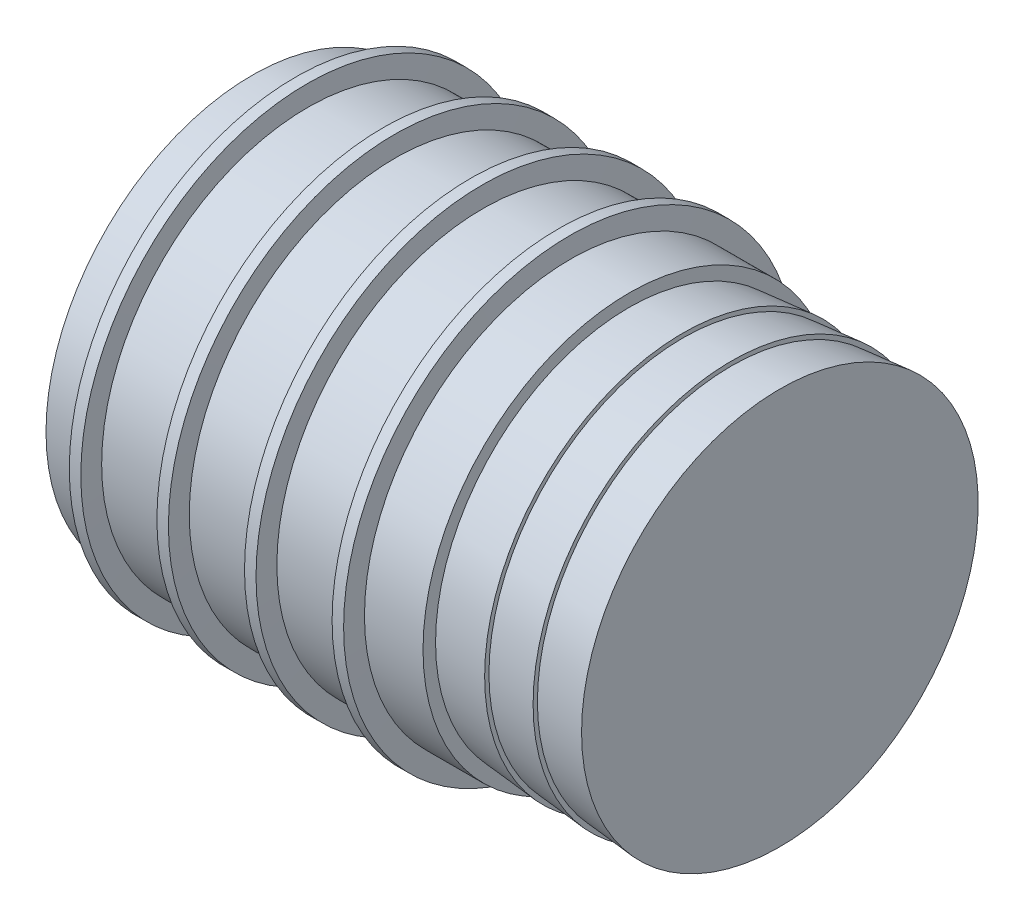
ISO-10303-21;
HEADER;
FILE_DESCRIPTION(('STEP AP214'),'2;1');
FILE_NAME('part.step','',(''),(''),'','','');
FILE_SCHEMA(('AUTOMOTIVE_DESIGN { 1 0 10303 214 1 1 1 1 }'));
ENDSEC;
DATA;
#1=APPLICATION_CONTEXT('core data for automotive mechanical design processes');
#2=APPLICATION_PROTOCOL_DEFINITION('international standard','automotive_design',2000,#1);
#3=PRODUCT_CONTEXT('',#1,'mechanical');
#4=PRODUCT('Part','Part','',(#3));
#5=PRODUCT_RELATED_PRODUCT_CATEGORY('part','',(#4));
#6=PRODUCT_DEFINITION_FORMATION('','',#4);
#7=PRODUCT_DEFINITION_CONTEXT('part definition',#1,'design');
#8=PRODUCT_DEFINITION('design','',#6,#7);
#9=PRODUCT_DEFINITION_SHAPE('','',#8);
#10=(LENGTH_UNIT() NAMED_UNIT(*) SI_UNIT(.MILLI.,.METRE.));
#11=(NAMED_UNIT(*) PLANE_ANGLE_UNIT() SI_UNIT($,.RADIAN.));
#12=(NAMED_UNIT(*) SI_UNIT($,.STERADIAN.) SOLID_ANGLE_UNIT());
#13=UNCERTAINTY_MEASURE_WITH_UNIT(LENGTH_MEASURE(1.E-05),#10,'distance_accuracy_value','');
#14=(GEOMETRIC_REPRESENTATION_CONTEXT(3) GLOBAL_UNCERTAINTY_ASSIGNED_CONTEXT((#13)) GLOBAL_UNIT_ASSIGNED_CONTEXT((#10,
#11,#12)) REPRESENTATION_CONTEXT('',''));
#15=CARTESIAN_POINT('',(0.,0.,0.));
#16=DIRECTION('',(0.,0.,1.));
#17=DIRECTION('',(1.,0.,0.));
#18=AXIS2_PLACEMENT_3D('',#15,#16,#17);
#19=CARTESIAN_POINT('',(14.,0.,0.));
#20=DIRECTION('',(1.,0.,0.));
#21=DIRECTION('',(0.,0.,-1.));
#22=AXIS2_PLACEMENT_3D('',#19,#20,#21);
#23=PLANE('',#22);
#24=CARTESIAN_POINT('',(14.,0.,0.));
#25=DIRECTION('',(-1.,0.,0.));
#26=DIRECTION('',(0.,0.,1.));
#27=AXIS2_PLACEMENT_3D('',#24,#25,#26);
#28=CIRCLE('',#27,5.25968968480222);
#29=CARTESIAN_POINT('',(14.,0.,5.25968968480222));
#30=VERTEX_POINT('',#29);
#31=EDGE_CURVE('E9',#30,#30,#28,.T.);
#32=ORIENTED_EDGE('',*,*,#31,.F.);
#33=EDGE_LOOP('',(#32));
#34=FACE_BOUND('',#33,.T.);
#35=ADVANCED_FACE('F14',(#34),#23,.T.);
#36=CARTESIAN_POINT('',(12.7144174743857,0.,0.));
#37=DIRECTION('',(1.,0.,0.));
#38=DIRECTION('',(0.,0.,-1.));
#39=AXIS2_PLACEMENT_3D('',#36,#37,#38);
#40=CONICAL_SURFACE('',#39,5.14550437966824,0.0885874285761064);
#41=ORIENTED_EDGE('',*,*,#31,.T.);
#42=EDGE_LOOP('',(#41));
#43=FACE_BOUND('',#42,.T.);
#44=CARTESIAN_POINT('',(12.7144174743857,0.,0.));
#45=DIRECTION('',(-1.,0.,0.));
#46=DIRECTION('',(0.,0.,1.));
#47=AXIS2_PLACEMENT_3D('',#44,#45,#46);
#48=CIRCLE('',#47,5.14550437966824);
#49=CARTESIAN_POINT('',(12.7144174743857,0.,5.14550437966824));
#50=VERTEX_POINT('',#49);
#51=EDGE_CURVE('E20',#50,#50,#48,.T.);
#52=ORIENTED_EDGE('',*,*,#51,.F.);
#53=EDGE_LOOP('',(#52));
#54=FACE_BOUND('',#53,.T.);
#55=ADVANCED_FACE('F146',(#43,#54),#40,.T.);
#56=CARTESIAN_POINT('',(12.7144174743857,-1.93159692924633E-12,0.));
#57=DIRECTION('',(1.,0.,0.));
#58=DIRECTION('',(0.,0.,-1.));
#59=AXIS2_PLACEMENT_3D('',#56,#57,#58);
#60=PLANE('',#59);
#61=ORIENTED_EDGE('',*,*,#51,.T.);
#62=EDGE_LOOP('',(#61));
#63=FACE_BOUND('',#62,.T.);
#64=CARTESIAN_POINT('',(12.7144174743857,0.,0.));
#65=DIRECTION('',(-1.,0.,0.));
#66=DIRECTION('',(0.,0.,1.));
#67=AXIS2_PLACEMENT_3D('',#64,#65,#66);
#68=CIRCLE('',#67,5.25968968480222);
#69=CARTESIAN_POINT('',(12.7144174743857,0.,5.25968968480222));
#70=VERTEX_POINT('',#69);
#71=EDGE_CURVE('E24',#70,#70,#68,.T.);
#72=ORIENTED_EDGE('',*,*,#71,.F.);
#73=EDGE_LOOP('',(#72));
#74=FACE_BOUND('',#73,.T.);
#75=ADVANCED_FACE('F152',(#63,#74),#60,.T.);
#76=CARTESIAN_POINT('',(11.4288349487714,0.,0.));
#77=DIRECTION('',(1.,0.,0.));
#78=DIRECTION('',(0.,0.,-1.));
#79=AXIS2_PLACEMENT_3D('',#76,#77,#78);
#80=CONICAL_SURFACE('',#79,5.14550437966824,0.0885874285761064);
#81=ORIENTED_EDGE('',*,*,#71,.T.);
#82=EDGE_LOOP('',(#81));
#83=FACE_BOUND('',#82,.T.);
#84=CARTESIAN_POINT('',(11.4288349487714,0.,0.));
#85=DIRECTION('',(-1.,0.,0.));
#86=DIRECTION('',(0.,0.,1.));
#87=AXIS2_PLACEMENT_3D('',#84,#85,#86);
#88=CIRCLE('',#87,5.14550437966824);
#89=CARTESIAN_POINT('',(11.4288349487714,0.,5.14550437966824));
#90=VERTEX_POINT('',#89);
#91=EDGE_CURVE('E28',#90,#90,#88,.T.);
#92=ORIENTED_EDGE('',*,*,#91,.F.);
#93=EDGE_LOOP('',(#92));
#94=FACE_BOUND('',#93,.T.);
#95=ADVANCED_FACE('F157',(#83,#94),#80,.T.);
#96=CARTESIAN_POINT('',(11.4288349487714,-1.73628894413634E-12,0.));
#97=DIRECTION('',(1.,0.,0.));
#98=DIRECTION('',(0.,0.,-1.));
#99=AXIS2_PLACEMENT_3D('',#96,#97,#98);
#100=PLANE('',#99);
#101=ORIENTED_EDGE('',*,*,#91,.T.);
#102=EDGE_LOOP('',(#101));
#103=FACE_BOUND('',#102,.T.);
#104=CARTESIAN_POINT('',(11.4288349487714,0.,0.));
#105=DIRECTION('',(-1.,0.,0.));
#106=DIRECTION('',(0.,0.,1.));
#107=AXIS2_PLACEMENT_3D('',#104,#105,#106);
#108=CIRCLE('',#107,5.25968968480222);
#109=CARTESIAN_POINT('',(11.4288349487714,0.,5.25968968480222));
#110=VERTEX_POINT('',#109);
#111=EDGE_CURVE('E33',#110,#110,#108,.T.);
#112=ORIENTED_EDGE('',*,*,#111,.F.);
#113=EDGE_LOOP('',(#112));
#114=FACE_BOUND('',#113,.T.);
#115=ADVANCED_FACE('F163',(#103,#114),#100,.T.);
#116=CARTESIAN_POINT('',(10.,0.,0.));
#117=DIRECTION('',(1.,0.,0.));
#118=DIRECTION('',(0.,0.,-1.));
#119=AXIS2_PLACEMENT_3D('',#116,#117,#118);
#120=CONICAL_SURFACE('',#119,5.13278071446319,0.0885874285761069);
#121=ORIENTED_EDGE('',*,*,#111,.T.);
#122=EDGE_LOOP('',(#121));
#123=FACE_BOUND('',#122,.T.);
#124=CARTESIAN_POINT('',(10.,0.,0.));
#125=DIRECTION('',(-1.,0.,0.));
#126=DIRECTION('',(0.,0.,1.));
#127=AXIS2_PLACEMENT_3D('',#124,#125,#126);
#128=CIRCLE('',#127,5.13278071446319);
#129=CARTESIAN_POINT('',(10.,0.,5.13278071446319));
#130=VERTEX_POINT('',#129);
#131=EDGE_CURVE('E36',#130,#130,#128,.T.);
#132=ORIENTED_EDGE('',*,*,#131,.F.);
#133=EDGE_LOOP('',(#132));
#134=FACE_BOUND('',#133,.T.);
#135=ADVANCED_FACE('F167',(#123,#134),#120,.T.);
#136=CARTESIAN_POINT('',(10.,0.,0.));
#137=DIRECTION('',(1.,0.,0.));
#138=DIRECTION('',(0.,0.,-1.));
#139=AXIS2_PLACEMENT_3D('',#136,#137,#138);
#140=PLANE('',#139);
#141=ORIENTED_EDGE('',*,*,#131,.T.);
#142=EDGE_LOOP('',(#141));
#143=FACE_BOUND('',#142,.T.);
#144=CARTESIAN_POINT('',(10.,0.,0.));
#145=DIRECTION('',(-1.,0.,0.));
#146=DIRECTION('',(0.,0.,1.));
#147=AXIS2_PLACEMENT_3D('',#144,#145,#146);
#148=CIRCLE('',#147,5.46527574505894);
#149=CARTESIAN_POINT('',(10.,0.,5.46527574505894));
#150=VERTEX_POINT('',#149);
#151=EDGE_CURVE('E39',#150,#150,#148,.T.);
#152=ORIENTED_EDGE('',*,*,#151,.F.);
#153=EDGE_LOOP('',(#152));
#154=FACE_BOUND('',#153,.T.);
#155=ADVANCED_FACE('F171',(#143,#154),#140,.T.);
#156=CARTESIAN_POINT('',(0.,0.,0.));
#157=DIRECTION('',(-1.,0.,0.));
#158=DIRECTION('',(0.,0.,1.));
#159=AXIS2_PLACEMENT_3D('',#156,#157,#158);
#160=CYLINDRICAL_SURFACE('',#159,5.46527574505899);
#161=CARTESIAN_POINT('',(8.44678294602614,0.,0.));
#162=DIRECTION('',(-1.,0.,0.));
#163=DIRECTION('',(0.,0.,1.));
#164=AXIS2_PLACEMENT_3D('',#161,#162,#163);
#165=CIRCLE('',#164,5.46527574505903);
#166=CARTESIAN_POINT('',(8.44678294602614,0.,5.46527574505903));
#167=VERTEX_POINT('',#166);
#168=EDGE_CURVE('E42',#167,#167,#165,.T.);
#169=ORIENTED_EDGE('',*,*,#168,.F.);
#170=EDGE_LOOP('',(#169));
#171=FACE_BOUND('',#170,.T.);
#172=ORIENTED_EDGE('',*,*,#151,.T.);
#173=EDGE_LOOP('',(#172));
#174=FACE_BOUND('',#173,.T.);
#175=ADVANCED_FACE('F175',(#171,#174),#160,.T.);
#176=CARTESIAN_POINT('',(8.44678294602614,0.,0.));
#177=DIRECTION('',(-1.,0.,0.));
#178=DIRECTION('',(0.,0.,1.));
#179=AXIS2_PLACEMENT_3D('',#176,#177,#178);
#180=CONICAL_SURFACE('',#179,5.46527574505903,1.53691646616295);
#181=CARTESIAN_POINT('',(8.42865962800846,0.,0.));
#182=DIRECTION('',(-1.,0.,0.));
#183=DIRECTION('',(0.,0.,1.));
#184=AXIS2_PLACEMENT_3D('',#181,#182,#183);
#185=CIRCLE('',#184,6.0000000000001);
#186=CARTESIAN_POINT('',(8.42865962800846,0.,6.0000000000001));
#187=VERTEX_POINT('',#186);
#188=EDGE_CURVE('E45',#187,#187,#185,.T.);
#189=ORIENTED_EDGE('',*,*,#188,.F.);
#190=EDGE_LOOP('',(#189));
#191=FACE_BOUND('',#190,.T.);
#192=ORIENTED_EDGE('',*,*,#168,.T.);
#193=EDGE_LOOP('',(#192));
#194=FACE_BOUND('',#193,.T.);
#195=ADVANCED_FACE('F179',(#191,#194),#180,.T.);
#196=CARTESIAN_POINT('',(0.,0.,0.));
#197=DIRECTION('',(-1.,0.,0.));
#198=DIRECTION('',(0.,0.,1.));
#199=AXIS2_PLACEMENT_3D('',#196,#197,#198);
#200=CYLINDRICAL_SURFACE('',#199,6.0000000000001);
#201=ORIENTED_EDGE('',*,*,#188,.T.);
#202=EDGE_LOOP('',(#201));
#203=FACE_BOUND('',#202,.T.);
#204=CARTESIAN_POINT('',(8.12328147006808,0.,0.));
#205=DIRECTION('',(-1.,0.,0.));
#206=DIRECTION('',(0.,0.,1.));
#207=AXIS2_PLACEMENT_3D('',#204,#205,#206);
#208=CIRCLE('',#207,6.0000000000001);
#209=CARTESIAN_POINT('',(8.12328147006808,0.,6.0000000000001));
#210=VERTEX_POINT('',#209);
#211=EDGE_CURVE('E48',#210,#210,#208,.T.);
#212=ORIENTED_EDGE('',*,*,#211,.F.);
#213=EDGE_LOOP('',(#212));
#214=FACE_BOUND('',#213,.T.);
#215=ADVANCED_FACE('F183',(#203,#214),#200,.T.);
#216=CARTESIAN_POINT('',(8.10515815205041,0.,0.));
#217=DIRECTION('',(1.,0.,0.));
#218=DIRECTION('',(0.,0.,-1.));
#219=AXIS2_PLACEMENT_3D('',#216,#217,#218);
#220=CONICAL_SURFACE('',#219,5.46527574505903,1.53691646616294);
#221=ORIENTED_EDGE('',*,*,#211,.T.);
#222=EDGE_LOOP('',(#221));
#223=FACE_BOUND('',#222,.T.);
#224=CARTESIAN_POINT('',(8.10515815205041,0.,0.));
#225=DIRECTION('',(-1.,0.,0.));
#226=DIRECTION('',(0.,0.,1.));
#227=AXIS2_PLACEMENT_3D('',#224,#225,#226);
#228=CIRCLE('',#227,5.46527574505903);
#229=CARTESIAN_POINT('',(8.10515815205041,0.,5.46527574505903));
#230=VERTEX_POINT('',#229);
#231=EDGE_CURVE('E51',#230,#230,#228,.T.);
#232=ORIENTED_EDGE('',*,*,#231,.F.);
#233=EDGE_LOOP('',(#232));
#234=FACE_BOUND('',#233,.T.);
#235=ADVANCED_FACE('F187',(#223,#234),#220,.T.);
#236=CARTESIAN_POINT('',(0.,0.,0.));
#237=DIRECTION('',(-1.,0.,0.));
#238=DIRECTION('',(0.,0.,1.));
#239=AXIS2_PLACEMENT_3D('',#236,#237,#238);
#240=CYLINDRICAL_SURFACE('',#239,5.46527574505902);
#241=CARTESIAN_POINT('',(6.12328837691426,0.,0.));
#242=DIRECTION('',(-1.,0.,0.));
#243=DIRECTION('',(0.,0.,1.));
#244=AXIS2_PLACEMENT_3D('',#241,#242,#243);
#245=CIRCLE('',#244,5.465275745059);
#246=CARTESIAN_POINT('',(6.12328837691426,0.,5.465275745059));
#247=VERTEX_POINT('',#246);
#248=EDGE_CURVE('E54',#247,#247,#245,.T.);
#249=ORIENTED_EDGE('',*,*,#248,.F.);
#250=EDGE_LOOP('',(#249));
#251=FACE_BOUND('',#250,.T.);
#252=ORIENTED_EDGE('',*,*,#231,.T.);
#253=EDGE_LOOP('',(#252));
#254=FACE_BOUND('',#253,.T.);
#255=ADVANCED_FACE('F191',(#251,#254),#240,.T.);
#256=CARTESIAN_POINT('',(6.12328837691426,0.,0.));
#257=DIRECTION('',(-1.,0.,0.));
#258=DIRECTION('',(0.,0.,1.));
#259=AXIS2_PLACEMENT_3D('',#256,#257,#258);
#260=CONICAL_SURFACE('',#259,5.465275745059,1.53691646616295);
#261=CARTESIAN_POINT('',(6.10516505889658,0.,0.));
#262=DIRECTION('',(-1.,0.,0.));
#263=DIRECTION('',(0.,0.,1.));
#264=AXIS2_PLACEMENT_3D('',#261,#262,#263);
#265=CIRCLE('',#264,6.00000000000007);
#266=CARTESIAN_POINT('',(6.10516505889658,0.,6.00000000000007));
#267=VERTEX_POINT('',#266);
#268=EDGE_CURVE('E57',#267,#267,#265,.T.);
#269=ORIENTED_EDGE('',*,*,#268,.F.);
#270=EDGE_LOOP('',(#269));
#271=FACE_BOUND('',#270,.T.);
#272=ORIENTED_EDGE('',*,*,#248,.T.);
#273=EDGE_LOOP('',(#272));
#274=FACE_BOUND('',#273,.T.);
#275=ADVANCED_FACE('F195',(#271,#274),#260,.T.);
#276=CARTESIAN_POINT('',(0.,0.,0.));
#277=DIRECTION('',(-1.,0.,0.));
#278=DIRECTION('',(0.,0.,1.));
#279=AXIS2_PLACEMENT_3D('',#276,#277,#278);
#280=CYLINDRICAL_SURFACE('',#279,6.00000000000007);
#281=ORIENTED_EDGE('',*,*,#268,.T.);
#282=EDGE_LOOP('',(#281));
#283=FACE_BOUND('',#282,.T.);
#284=CARTESIAN_POINT('',(5.7997869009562,0.,0.));
#285=DIRECTION('',(-1.,0.,0.));
#286=DIRECTION('',(0.,0.,1.));
#287=AXIS2_PLACEMENT_3D('',#284,#285,#286);
#288=CIRCLE('',#287,6.00000000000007);
#289=CARTESIAN_POINT('',(5.7997869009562,0.,6.00000000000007));
#290=VERTEX_POINT('',#289);
#291=EDGE_CURVE('E60',#290,#290,#288,.T.);
#292=ORIENTED_EDGE('',*,*,#291,.F.);
#293=EDGE_LOOP('',(#292));
#294=FACE_BOUND('',#293,.T.);
#295=ADVANCED_FACE('F199',(#283,#294),#280,.T.);
#296=CARTESIAN_POINT('',(5.78166358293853,0.,0.));
#297=DIRECTION('',(1.,0.,0.));
#298=DIRECTION('',(0.,0.,-1.));
#299=AXIS2_PLACEMENT_3D('',#296,#297,#298);
#300=CONICAL_SURFACE('',#299,5.465275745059,1.53691646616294);
#301=ORIENTED_EDGE('',*,*,#291,.T.);
#302=EDGE_LOOP('',(#301));
#303=FACE_BOUND('',#302,.T.);
#304=CARTESIAN_POINT('',(5.78166358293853,0.,0.));
#305=DIRECTION('',(-1.,0.,0.));
#306=DIRECTION('',(0.,0.,1.));
#307=AXIS2_PLACEMENT_3D('',#304,#305,#306);
#308=CIRCLE('',#307,5.465275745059);
#309=CARTESIAN_POINT('',(5.78166358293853,0.,5.465275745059));
#310=VERTEX_POINT('',#309);
#311=EDGE_CURVE('E63',#310,#310,#308,.T.);
#312=ORIENTED_EDGE('',*,*,#311,.F.);
#313=EDGE_LOOP('',(#312));
#314=FACE_BOUND('',#313,.T.);
#315=ADVANCED_FACE('F203',(#303,#314),#300,.T.);
#316=CARTESIAN_POINT('',(0.,0.,0.));
#317=DIRECTION('',(-1.,0.,0.));
#318=DIRECTION('',(0.,0.,1.));
#319=AXIS2_PLACEMENT_3D('',#316,#317,#318);
#320=CYLINDRICAL_SURFACE('',#319,5.46527574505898);
#321=CARTESIAN_POINT('',(3.79979380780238,0.,0.));
#322=DIRECTION('',(-1.,0.,0.));
#323=DIRECTION('',(0.,0.,1.));
#324=AXIS2_PLACEMENT_3D('',#321,#322,#323);
#325=CIRCLE('',#324,5.46527574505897);
#326=CARTESIAN_POINT('',(3.79979380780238,0.,5.46527574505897));
#327=VERTEX_POINT('',#326);
#328=EDGE_CURVE('E66',#327,#327,#325,.T.);
#329=ORIENTED_EDGE('',*,*,#328,.F.);
#330=EDGE_LOOP('',(#329));
#331=FACE_BOUND('',#330,.T.);
#332=ORIENTED_EDGE('',*,*,#311,.T.);
#333=EDGE_LOOP('',(#332));
#334=FACE_BOUND('',#333,.T.);
#335=ADVANCED_FACE('F207',(#331,#334),#320,.T.);
#336=CARTESIAN_POINT('',(3.79979380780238,0.,0.));
#337=DIRECTION('',(-1.,0.,0.));
#338=DIRECTION('',(0.,0.,1.));
#339=AXIS2_PLACEMENT_3D('',#336,#337,#338);
#340=CONICAL_SURFACE('',#339,5.46527574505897,1.53691646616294);
#341=CARTESIAN_POINT('',(3.7816704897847,0.,0.));
#342=DIRECTION('',(-1.,0.,0.));
#343=DIRECTION('',(0.,0.,1.));
#344=AXIS2_PLACEMENT_3D('',#341,#342,#343);
#345=CIRCLE('',#344,6.);
#346=CARTESIAN_POINT('',(3.7816704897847,0.,6.));
#347=VERTEX_POINT('',#346);
#348=EDGE_CURVE('E69',#347,#347,#345,.T.);
#349=ORIENTED_EDGE('',*,*,#348,.F.);
#350=EDGE_LOOP('',(#349));
#351=FACE_BOUND('',#350,.T.);
#352=ORIENTED_EDGE('',*,*,#328,.T.);
#353=EDGE_LOOP('',(#352));
#354=FACE_BOUND('',#353,.T.);
#355=ADVANCED_FACE('F211',(#351,#354),#340,.T.);
#356=CARTESIAN_POINT('',(0.,0.,0.));
#357=DIRECTION('',(-1.,0.,0.));
#358=DIRECTION('',(0.,0.,1.));
#359=AXIS2_PLACEMENT_3D('',#356,#357,#358);
#360=CYLINDRICAL_SURFACE('',#359,6.);
#361=ORIENTED_EDGE('',*,*,#348,.T.);
#362=EDGE_LOOP('',(#361));
#363=FACE_BOUND('',#362,.T.);
#364=CARTESIAN_POINT('',(3.47629233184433,0.,0.));
#365=DIRECTION('',(-1.,0.,0.));
#366=DIRECTION('',(0.,0.,1.));
#367=AXIS2_PLACEMENT_3D('',#364,#365,#366);
#368=CIRCLE('',#367,6.);
#369=CARTESIAN_POINT('',(3.47629233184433,0.,6.));
#370=VERTEX_POINT('',#369);
#371=EDGE_CURVE('E72',#370,#370,#368,.T.);
#372=ORIENTED_EDGE('',*,*,#371,.F.);
#373=EDGE_LOOP('',(#372));
#374=FACE_BOUND('',#373,.T.);
#375=ADVANCED_FACE('F215',(#363,#374),#360,.T.);
#376=CARTESIAN_POINT('',(3.45816901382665,0.,0.));
#377=DIRECTION('',(1.,0.,0.));
#378=DIRECTION('',(0.,0.,-1.));
#379=AXIS2_PLACEMENT_3D('',#376,#377,#378);
#380=CONICAL_SURFACE('',#379,5.46527574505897,1.53691646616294);
#381=ORIENTED_EDGE('',*,*,#371,.T.);
#382=EDGE_LOOP('',(#381));
#383=FACE_BOUND('',#382,.T.);
#384=CARTESIAN_POINT('',(3.45816901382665,0.,0.));
#385=DIRECTION('',(-1.,0.,0.));
#386=DIRECTION('',(0.,0.,1.));
#387=AXIS2_PLACEMENT_3D('',#384,#385,#386);
#388=CIRCLE('',#387,5.46527574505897);
#389=CARTESIAN_POINT('',(3.45816901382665,0.,5.46527574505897));
#390=VERTEX_POINT('',#389);
#391=EDGE_CURVE('E75',#390,#390,#388,.T.);
#392=ORIENTED_EDGE('',*,*,#391,.F.);
#393=EDGE_LOOP('',(#392));
#394=FACE_BOUND('',#393,.T.);
#395=ADVANCED_FACE('F219',(#383,#394),#380,.T.);
#396=CARTESIAN_POINT('',(0.,0.,0.));
#397=DIRECTION('',(-1.,0.,0.));
#398=DIRECTION('',(0.,0.,1.));
#399=AXIS2_PLACEMENT_3D('',#396,#397,#398);
#400=CYLINDRICAL_SURFACE('',#399,5.46527574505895);
#401=CARTESIAN_POINT('',(1.4762992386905,0.,0.));
#402=DIRECTION('',(-1.,0.,0.));
#403=DIRECTION('',(0.,0.,1.));
#404=AXIS2_PLACEMENT_3D('',#401,#402,#403);
#405=CIRCLE('',#404,5.46527574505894);
#406=CARTESIAN_POINT('',(1.4762992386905,0.,5.46527574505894));
#407=VERTEX_POINT('',#406);
#408=EDGE_CURVE('E78',#407,#407,#405,.T.);
#409=ORIENTED_EDGE('',*,*,#408,.F.);
#410=EDGE_LOOP('',(#409));
#411=FACE_BOUND('',#410,.T.);
#412=ORIENTED_EDGE('',*,*,#391,.T.);
#413=EDGE_LOOP('',(#412));
#414=FACE_BOUND('',#413,.T.);
#415=ADVANCED_FACE('F223',(#411,#414),#400,.T.);
#416=CARTESIAN_POINT('',(1.4762992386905,0.,0.));
#417=DIRECTION('',(-1.,0.,0.));
#418=DIRECTION('',(0.,0.,1.));
#419=AXIS2_PLACEMENT_3D('',#416,#417,#418);
#420=CONICAL_SURFACE('',#419,5.46527574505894,1.53691646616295);
#421=CARTESIAN_POINT('',(1.45817592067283,0.,0.));
#422=DIRECTION('',(-1.,0.,0.));
#423=DIRECTION('',(0.,0.,1.));
#424=AXIS2_PLACEMENT_3D('',#421,#422,#423);
#425=CIRCLE('',#424,6.);
#426=CARTESIAN_POINT('',(1.45817592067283,0.,6.));
#427=VERTEX_POINT('',#426);
#428=EDGE_CURVE('E81',#427,#427,#425,.T.);
#429=ORIENTED_EDGE('',*,*,#428,.F.);
#430=EDGE_LOOP('',(#429));
#431=FACE_BOUND('',#430,.T.);
#432=ORIENTED_EDGE('',*,*,#408,.T.);
#433=EDGE_LOOP('',(#432));
#434=FACE_BOUND('',#433,.T.);
#435=ADVANCED_FACE('F227',(#431,#434),#420,.T.);
#436=CARTESIAN_POINT('',(0.,0.,0.));
#437=DIRECTION('',(-1.,0.,0.));
#438=DIRECTION('',(0.,0.,1.));
#439=AXIS2_PLACEMENT_3D('',#436,#437,#438);
#440=CYLINDRICAL_SURFACE('',#439,6.);
#441=ORIENTED_EDGE('',*,*,#428,.T.);
#442=EDGE_LOOP('',(#441));
#443=FACE_BOUND('',#442,.T.);
#444=CARTESIAN_POINT('',(1.15279776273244,0.,0.));
#445=DIRECTION('',(-1.,0.,0.));
#446=DIRECTION('',(0.,0.,1.));
#447=AXIS2_PLACEMENT_3D('',#444,#445,#446);
#448=CIRCLE('',#447,6.);
#449=CARTESIAN_POINT('',(1.15279776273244,0.,6.));
#450=VERTEX_POINT('',#449);
#451=EDGE_CURVE('E84',#450,#450,#448,.T.);
#452=ORIENTED_EDGE('',*,*,#451,.F.);
#453=EDGE_LOOP('',(#452));
#454=FACE_BOUND('',#453,.T.);
#455=ADVANCED_FACE('F142',(#443,#454),#440,.T.);
#456=CARTESIAN_POINT('',(1.13467444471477,0.,0.));
#457=DIRECTION('',(1.,0.,0.));
#458=DIRECTION('',(0.,0.,-1.));
#459=AXIS2_PLACEMENT_3D('',#456,#457,#458);
#460=CONICAL_SURFACE('',#459,5.46527574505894,1.53691646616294);
#461=ORIENTED_EDGE('',*,*,#451,.T.);
#462=EDGE_LOOP('',(#461));
#463=FACE_BOUND('',#462,.T.);
#464=CARTESIAN_POINT('',(1.13467444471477,0.,0.));
#465=DIRECTION('',(-1.,0.,0.));
#466=DIRECTION('',(0.,0.,1.));
#467=AXIS2_PLACEMENT_3D('',#464,#465,#466);
#468=CIRCLE('',#467,5.46527574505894);
#469=CARTESIAN_POINT('',(1.13467444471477,0.,5.46527574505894));
#470=VERTEX_POINT('',#469);
#471=EDGE_CURVE('E87',#470,#470,#468,.T.);
#472=ORIENTED_EDGE('',*,*,#471,.F.);
#473=EDGE_LOOP('',(#472));
#474=FACE_BOUND('',#473,.T.);
#475=ADVANCED_FACE('F134',(#463,#474),#460,.T.);
#476=CARTESIAN_POINT('',(0.,0.,0.));
#477=DIRECTION('',(-1.,0.,0.));
#478=DIRECTION('',(0.,0.,1.));
#479=AXIS2_PLACEMENT_3D('',#476,#477,#478);
#480=CYLINDRICAL_SURFACE('',#479,5.46527574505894);
#481=ORIENTED_EDGE('',*,*,#471,.T.);
#482=EDGE_LOOP('',(#481));
#483=FACE_BOUND('',#482,.T.);
#484=CARTESIAN_POINT('',(0.,0.,0.));
#485=DIRECTION('',(-1.,0.,0.));
#486=DIRECTION('',(0.,0.,1.));
#487=AXIS2_PLACEMENT_3D('',#484,#485,#486);
#488=CIRCLE('',#487,5.46527574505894);
#489=CARTESIAN_POINT('',(0.,0.,5.46527574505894));
#490=VERTEX_POINT('',#489);
#491=EDGE_CURVE('E90',#490,#490,#488,.T.);
#492=ORIENTED_EDGE('',*,*,#491,.F.);
#493=EDGE_LOOP('',(#492));
#494=FACE_BOUND('',#493,.T.);
#495=ADVANCED_FACE('F129',(#483,#494),#480,.T.);
#496=CARTESIAN_POINT('',(0.,0.,0.));
#497=DIRECTION('',(-1.,0.,0.));
#498=DIRECTION('',(0.,0.,1.));
#499=AXIS2_PLACEMENT_3D('',#496,#497,#498);
#500=PLANE('',#499);
#501=CARTESIAN_POINT('',(0.,0.,0.));
#502=DIRECTION('',(-1.,0.,0.));
#503=DIRECTION('',(0.,0.,1.));
#504=AXIS2_PLACEMENT_3D('',#501,#502,#503);
#505=CIRCLE('',#504,5.);
#506=CARTESIAN_POINT('',(0.,0.,5.));
#507=VERTEX_POINT('',#506);
#508=EDGE_CURVE('E96',#507,#507,#505,.T.);
#509=ORIENTED_EDGE('',*,*,#508,.F.);
#510=EDGE_LOOP('',(#509));
#511=FACE_BOUND('',#510,.T.);
#512=ORIENTED_EDGE('',*,*,#491,.T.);
#513=EDGE_LOOP('',(#512));
#514=FACE_BOUND('',#513,.T.);
#515=ADVANCED_FACE('F123',(#511,#514),#500,.T.);
#516=CARTESIAN_POINT('',(0.,0.,0.));
#517=DIRECTION('',(-1.,0.,0.));
#518=DIRECTION('',(0.,0.,1.));
#519=AXIS2_PLACEMENT_3D('',#516,#517,#518);
#520=CONICAL_SURFACE('',#519,5.,0.0349065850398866);
#521=CARTESIAN_POINT('',(2.,0.,0.));
#522=DIRECTION('',(-1.,0.,0.));
#523=DIRECTION('',(0.,0.,1.));
#524=AXIS2_PLACEMENT_3D('',#521,#522,#523);
#525=CIRCLE('',#524,4.9301584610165);
#526=CARTESIAN_POINT('',(2.,0.,4.9301584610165));
#527=VERTEX_POINT('',#526);
#528=EDGE_CURVE('E93',#527,#527,#525,.T.);
#529=ORIENTED_EDGE('',*,*,#528,.F.);
#530=EDGE_LOOP('',(#529));
#531=FACE_BOUND('',#530,.T.);
#532=ORIENTED_EDGE('',*,*,#508,.T.);
#533=EDGE_LOOP('',(#532));
#534=FACE_BOUND('',#533,.T.);
#535=ADVANCED_FACE('F117',(#531,#534),#520,.F.);
#536=CARTESIAN_POINT('',(2.,0.,0.));
#537=DIRECTION('',(-1.,0.,0.));
#538=DIRECTION('',(0.,0.,1.));
#539=AXIS2_PLACEMENT_3D('',#536,#537,#538);
#540=PLANE('',#539);
#541=CARTESIAN_POINT('',(2.,0.,0.));
#542=DIRECTION('',(-1.,0.,0.));
#543=DIRECTION('',(0.,0.,1.));
#544=AXIS2_PLACEMENT_3D('',#541,#542,#543);
#545=CIRCLE('',#544,3.);
#546=CARTESIAN_POINT('',(2.,0.,3.));
#547=VERTEX_POINT('',#546);
#548=EDGE_CURVE('E100',#547,#547,#545,.T.);
#549=ORIENTED_EDGE('',*,*,#548,.F.);
#550=EDGE_LOOP('',(#549));
#551=FACE_BOUND('',#550,.T.);
#552=ORIENTED_EDGE('',*,*,#528,.T.);
#553=EDGE_LOOP('',(#552));
#554=FACE_BOUND('',#553,.T.);
#555=ADVANCED_FACE('F111',(#551,#554),#540,.T.);
#556=CARTESIAN_POINT('',(6.,0.,0.));
#557=DIRECTION('',(-1.,0.,0.));
#558=DIRECTION('',(0.,0.,1.));
#559=AXIS2_PLACEMENT_3D('',#556,#557,#558);
#560=CYLINDRICAL_SURFACE('',#559,3.);
#561=CARTESIAN_POINT('',(6.,0.,0.));
#562=DIRECTION('',(-1.,0.,0.));
#563=DIRECTION('',(0.,0.,1.));
#564=AXIS2_PLACEMENT_3D('',#561,#562,#563);
#565=CIRCLE('',#564,3.);
#566=CARTESIAN_POINT('',(6.,0.,3.));
#567=VERTEX_POINT('',#566);
#568=EDGE_CURVE('E99',#567,#567,#565,.T.);
#569=ORIENTED_EDGE('',*,*,#568,.F.);
#570=EDGE_LOOP('',(#569));
#571=FACE_BOUND('',#570,.T.);
#572=ORIENTED_EDGE('',*,*,#548,.T.);
#573=EDGE_LOOP('',(#572));
#574=FACE_BOUND('',#573,.T.);
#575=ADVANCED_FACE('F108',(#571,#574),#560,.F.);
#576=CARTESIAN_POINT('',(6.,0.,0.));
#577=DIRECTION('',(-1.,0.,0.));
#578=DIRECTION('',(0.,0.,1.));
#579=AXIS2_PLACEMENT_3D('',#576,#577,#578);
#580=PLANE('',#579);
#581=ORIENTED_EDGE('',*,*,#568,.T.);
#582=EDGE_LOOP('',(#581));
#583=FACE_BOUND('',#582,.T.);
#584=ADVANCED_FACE('F106',(#583),#580,.T.);
#585=CLOSED_SHELL('',(#35,#55,#75,#95,#115,#135,#155,#175,#195,#215,#235,#255,#275,#295,#315,
#335,#355,#375,#395,#415,#435,#455,#475,#495,#515,#535,#555,#575,#584));
#586=MANIFOLD_SOLID_BREP('B1',#585);
#587=ADVANCED_BREP_SHAPE_REPRESENTATION('',(#18,#586),#14);
#588=SHAPE_DEFINITION_REPRESENTATION(#9,#587);
ENDSEC;
END-ISO-10303-21;
